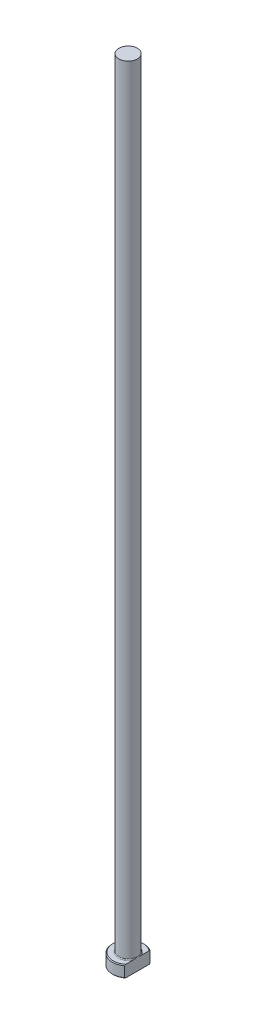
ISO-10303-21;
HEADER;
FILE_DESCRIPTION(('STEP AP214'),'2;1');
FILE_NAME('part.step','',(''),(''),'','','');
FILE_SCHEMA(('AUTOMOTIVE_DESIGN { 1 0 10303 214 1 1 1 1 }'));
ENDSEC;
DATA;
#1=APPLICATION_CONTEXT('core data for automotive mechanical design processes');
#2=APPLICATION_PROTOCOL_DEFINITION('international standard','automotive_design',2000,#1);
#3=PRODUCT_CONTEXT('',#1,'mechanical');
#4=PRODUCT('Part','Part','',(#3));
#5=PRODUCT_RELATED_PRODUCT_CATEGORY('part','',(#4));
#6=PRODUCT_DEFINITION_FORMATION('','',#4);
#7=PRODUCT_DEFINITION_CONTEXT('part definition',#1,'design');
#8=PRODUCT_DEFINITION('design','',#6,#7);
#9=PRODUCT_DEFINITION_SHAPE('','',#8);
#10=(LENGTH_UNIT() NAMED_UNIT(*) SI_UNIT(.MILLI.,.METRE.));
#11=(NAMED_UNIT(*) PLANE_ANGLE_UNIT() SI_UNIT($,.RADIAN.));
#12=(NAMED_UNIT(*) SI_UNIT($,.STERADIAN.) SOLID_ANGLE_UNIT());
#13=UNCERTAINTY_MEASURE_WITH_UNIT(LENGTH_MEASURE(1.E-05),#10,'distance_accuracy_value','');
#14=(GEOMETRIC_REPRESENTATION_CONTEXT(3) GLOBAL_UNCERTAINTY_ASSIGNED_CONTEXT((#13)) GLOBAL_UNIT_ASSIGNED_CONTEXT((#10,
#11,#12)) REPRESENTATION_CONTEXT('',''));
#15=CARTESIAN_POINT('',(0.,0.,0.));
#16=DIRECTION('',(0.,0.,1.));
#17=DIRECTION('',(1.,0.,0.));
#18=AXIS2_PLACEMENT_3D('',#15,#16,#17);
#19=CARTESIAN_POINT('',(0.,0.,0.));
#20=DIRECTION('',(0.,-1.,0.));
#21=DIRECTION('',(0.,0.,-1.));
#22=AXIS2_PLACEMENT_3D('',#19,#20,#21);
#23=PLANE('',#22);
#24=CARTESIAN_POINT('',(0.,0.,0.));
#25=DIRECTION('',(0.,-1.,0.));
#26=DIRECTION('',(0.,0.,-1.));
#27=AXIS2_PLACEMENT_3D('',#24,#25,#26);
#28=CIRCLE('',#27,3.79999999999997);
#29=CARTESIAN_POINT('',(2.34999999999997,0.,2.98621834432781));
#30=VERTEX_POINT('',#29);
#31=CARTESIAN_POINT('',(2.34999999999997,0.,-2.98621834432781));
#32=VERTEX_POINT('',#31);
#33=EDGE_CURVE('E98',#30,#32,#28,.T.);
#34=ORIENTED_EDGE('',*,*,#33,.T.);
#35=DIRECTION('',(0.,0.,1.));
#36=VECTOR('',#35,1.);
#37=CARTESIAN_POINT('',(2.34999999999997,0.,-3.23689666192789));
#38=LINE('',#37,#36);
#39=EDGE_CURVE('E83',#32,#30,#38,.T.);
#40=ORIENTED_EDGE('',*,*,#39,.T.);
#41=EDGE_LOOP('',(#34,#40));
#42=FACE_BOUND('',#41,.T.);
#43=ADVANCED_FACE('F32',(#42),#23,.T.);
#44=CARTESIAN_POINT('',(0.,259.958771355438,0.));
#45=DIRECTION('',(0.,1.,0.));
#46=DIRECTION('',(0.,0.,1.));
#47=AXIS2_PLACEMENT_3D('',#44,#45,#46);
#48=CYLINDRICAL_SURFACE('',#47,3.99999999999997);
#49=CARTESIAN_POINT('',(0.,2.80000000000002,0.));
#50=DIRECTION('',(0.,1.,0.));
#51=DIRECTION('',(0.,0.,1.));
#52=AXIS2_PLACEMENT_3D('',#49,#50,#51);
#53=CIRCLE('',#52,3.99999999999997);
#54=CARTESIAN_POINT('',(2.34999999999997,2.80000000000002,3.23689666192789));
#55=VERTEX_POINT('',#54);
#56=CARTESIAN_POINT('',(2.34999999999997,2.80000000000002,-3.23689666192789));
#57=VERTEX_POINT('',#56);
#58=EDGE_CURVE('E104',#55,#57,#53,.F.);
#59=ORIENTED_EDGE('',*,*,#58,.T.);
#60=DIRECTION('',(0.,-1.,0.));
#61=VECTOR('',#60,1.);
#62=CARTESIAN_POINT('',(2.34999999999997,200.,-3.23689666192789));
#63=LINE('',#62,#61);
#64=CARTESIAN_POINT('',(2.34999999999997,0.199999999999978,-3.23689666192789));
#65=VERTEX_POINT('',#64);
#66=EDGE_CURVE('E183',#57,#65,#63,.T.);
#67=ORIENTED_EDGE('',*,*,#66,.T.);
#68=CARTESIAN_POINT('',(0.,0.199999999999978,0.));
#69=DIRECTION('',(0.,-1.,0.));
#70=DIRECTION('',(0.,0.,-1.));
#71=AXIS2_PLACEMENT_3D('',#68,#69,#70);
#72=CIRCLE('',#71,3.99999999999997);
#73=CARTESIAN_POINT('',(2.34999999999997,0.199999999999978,3.23689666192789));
#74=VERTEX_POINT('',#73);
#75=EDGE_CURVE('E100',#65,#74,#72,.F.);
#76=ORIENTED_EDGE('',*,*,#75,.T.);
#77=DIRECTION('',(0.,-1.,0.));
#78=VECTOR('',#77,1.);
#79=CARTESIAN_POINT('',(2.34999999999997,200.,3.23689666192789));
#80=LINE('',#79,#78);
#81=EDGE_CURVE('E93',#55,#74,#80,.T.);
#82=ORIENTED_EDGE('',*,*,#81,.F.);
#83=EDGE_LOOP('',(#59,#67,#76,#82));
#84=FACE_BOUND('',#83,.T.);
#85=ADVANCED_FACE('F158',(#84),#48,.T.);
#86=CARTESIAN_POINT('',(-3.99999999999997,3.,0.));
#87=DIRECTION('',(0.,1.,0.));
#88=DIRECTION('',(0.,0.,1.));
#89=AXIS2_PLACEMENT_3D('',#86,#87,#88);
#90=PLANE('',#89);
#91=CARTESIAN_POINT('',(0.,3.,0.));
#92=DIRECTION('',(0.,1.,0.));
#93=DIRECTION('',(0.,0.,1.));
#94=AXIS2_PLACEMENT_3D('',#91,#92,#93);
#95=CIRCLE('',#94,3.80000000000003);
#96=CARTESIAN_POINT('',(2.34999999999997,3.,-2.98621834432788));
#97=VERTEX_POINT('',#96);
#98=CARTESIAN_POINT('',(2.34999999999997,3.,2.98621834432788));
#99=VERTEX_POINT('',#98);
#100=EDGE_CURVE('E178',#97,#99,#95,.T.);
#101=ORIENTED_EDGE('',*,*,#100,.T.);
#102=DIRECTION('',(0.,0.,-1.));
#103=VECTOR('',#102,1.);
#104=CARTESIAN_POINT('',(2.34999999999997,3.,0.));
#105=LINE('',#104,#103);
#106=CARTESIAN_POINT('',(2.34999999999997,2.99999999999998,0.989949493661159));
#107=VERTEX_POINT('',#106);
#108=EDGE_CURVE('E57',#99,#107,#105,.T.);
#109=ORIENTED_EDGE('',*,*,#108,.T.);
#110=CARTESIAN_POINT('',(0.,3.,0.));
#111=DIRECTION('',(0.,1.,0.));
#112=DIRECTION('',(0.,0.,1.));
#113=AXIS2_PLACEMENT_3D('',#110,#111,#112);
#114=CIRCLE('',#113,2.54999999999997);
#115=CARTESIAN_POINT('',(2.34999999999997,2.99999999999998,-0.98994949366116));
#116=VERTEX_POINT('',#115);
#117=EDGE_CURVE('E107',#107,#116,#114,.F.);
#118=ORIENTED_EDGE('',*,*,#117,.T.);
#119=EDGE_CURVE('E136',#116,#97,#105,.T.);
#120=ORIENTED_EDGE('',*,*,#119,.T.);
#121=EDGE_LOOP('',(#101,#109,#118,#120));
#122=FACE_BOUND('',#121,.T.);
#123=ADVANCED_FACE('F147',(#122),#90,.T.);
#124=CARTESIAN_POINT('',(0.,3.,0.));
#125=DIRECTION('',(0.,-1.,0.));
#126=DIRECTION('',(0.,0.,-1.));
#127=AXIS2_PLACEMENT_3D('',#124,#125,#126);
#128=CONICAL_SURFACE('',#127,3.80000000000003,0.785398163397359);
#129=ORIENTED_EDGE('',*,*,#58,.F.);
#130=CARTESIAN_POINT('',(2.34999999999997,-0.700856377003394,7.12322584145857));
#131=CARTESIAN_POINT('',(2.34999999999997,-0.58594192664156,7.00221702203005));
#132=CARTESIAN_POINT('',(2.34999999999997,-0.471176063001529,6.88106709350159));
#133=CARTESIAN_POINT('',(2.34999999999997,-0.241996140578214,6.63843358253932));
#134=CARTESIAN_POINT('',(2.34999999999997,-0.127582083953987,6.51694999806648));
#135=CARTESIAN_POINT('',(2.34999999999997,0.215169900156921,6.15179430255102));
#136=CARTESIAN_POINT('',(2.34999999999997,0.442895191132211,5.90754596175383));
#137=CARTESIAN_POINT('',(2.34999999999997,0.899497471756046,5.41318459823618));
#138=CARTESIAN_POINT('',(2.34999999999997,1.12833917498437,5.16303891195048));
#139=CARTESIAN_POINT('',(2.34999999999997,1.5824117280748,4.65967689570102));
#140=CARTESIAN_POINT('',(2.34999999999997,1.8076441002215,4.40646194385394));
#141=CARTESIAN_POINT('',(2.34999999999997,2.21600221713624,3.93721563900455));
#142=CARTESIAN_POINT('',(2.34999999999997,2.39996239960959,3.7219156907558));
#143=CARTESIAN_POINT('',(2.34999999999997,2.67143803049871,3.39502060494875));
#144=CARTESIAN_POINT('',(2.34999999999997,2.76124091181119,3.28532776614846));
#145=CARTESIAN_POINT('',(2.34999999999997,2.93886030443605,3.06434945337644));
#146=CARTESIAN_POINT('',(2.34999999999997,3.02667691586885,2.95306406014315));
#147=CARTESIAN_POINT('',(2.34999999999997,3.19949645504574,2.72877711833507));
#148=CARTESIAN_POINT('',(2.34999999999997,3.28450603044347,2.61578071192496));
#149=CARTESIAN_POINT('',(2.34999999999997,3.45108912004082,2.38722377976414));
#150=CARTESIAN_POINT('',(2.34999999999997,3.53266178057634,2.27166262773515));
#151=CARTESIAN_POINT('',(2.34999999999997,3.69088588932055,2.03753037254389));
#152=CARTESIAN_POINT('',(2.34999999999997,3.7675467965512,1.9189657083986));
#153=CARTESIAN_POINT('',(2.34999999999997,3.91413135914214,1.67777357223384));
#154=CARTESIAN_POINT('',(2.34999999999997,3.98405924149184,1.5551487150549));
#155=CARTESIAN_POINT('',(2.34999999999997,4.09761312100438,1.33668409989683));
#156=CARTESIAN_POINT('',(2.34999999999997,4.1434014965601,1.24197842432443));
#157=CARTESIAN_POINT('',(2.34999999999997,4.22781425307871,1.04934973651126));
#158=CARTESIAN_POINT('',(2.34999999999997,4.26643728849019,0.951426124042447));
#159=CARTESIAN_POINT('',(2.34999999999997,4.33394568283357,0.753323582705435));
#160=CARTESIAN_POINT('',(2.34999999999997,4.3629260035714,0.653177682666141));
#161=CARTESIAN_POINT('',(2.34999999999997,4.40928787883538,0.450234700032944));
#162=CARTESIAN_POINT('',(2.34999999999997,4.42667991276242,0.347440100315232));
#163=CARTESIAN_POINT('',(2.34999999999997,4.44509392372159,0.169206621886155));
#164=CARTESIAN_POINT('',(2.34999999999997,4.44931933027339,0.0940925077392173));
#165=CARTESIAN_POINT('',(2.34999999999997,4.45052785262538,-0.0561912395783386));
#166=CARTESIAN_POINT('',(2.34999999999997,4.4475119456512,-0.13136086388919));
#167=CARTESIAN_POINT('',(2.34999999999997,4.43440638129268,-0.281306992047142));
#168=CARTESIAN_POINT('',(2.34999999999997,4.42429455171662,-0.356081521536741));
#169=CARTESIAN_POINT('',(2.34999999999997,4.39757556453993,-0.504456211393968));
#170=CARTESIAN_POINT('',(2.34999999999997,4.38096681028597,-0.578056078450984));
#171=CARTESIAN_POINT('',(2.34999999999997,4.3332884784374,-0.756675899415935));
#172=CARTESIAN_POINT('',(2.34999999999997,4.29907594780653,-0.860854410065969));
#173=CARTESIAN_POINT('',(2.34999999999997,4.22140056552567,-1.06568624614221));
#174=CARTESIAN_POINT('',(2.34999999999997,4.17793098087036,-1.16633694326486));
#175=CARTESIAN_POINT('',(2.34999999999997,4.08383876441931,-1.36480952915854));
#176=CARTESIAN_POINT('',(2.34999999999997,4.03318169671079,-1.46261489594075));
#177=CARTESIAN_POINT('',(2.34999999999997,3.95330034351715,-1.60710986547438));
#178=CARTESIAN_POINT('',(2.34999999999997,3.92602819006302,-1.65489920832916));
#179=CARTESIAN_POINT('',(2.34999999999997,3.8703483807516,-1.74981001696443));
#180=CARTESIAN_POINT('',(2.34999999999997,3.84194077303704,-1.79693151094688));
#181=CARTESIAN_POINT('',(2.34999999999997,3.74736854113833,-1.95015020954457));
#182=CARTESIAN_POINT('',(2.34999999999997,3.67916021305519,-2.05498710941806));
#183=CARTESIAN_POINT('',(2.34999999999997,3.53901640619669,-2.26214963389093));
#184=CARTESIAN_POINT('',(2.34999999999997,3.46708001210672,-2.36447463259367));
#185=CARTESIAN_POINT('',(2.34999999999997,3.32034981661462,-2.56716934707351));
#186=CARTESIAN_POINT('',(2.34999999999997,3.24555383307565,-2.66753747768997));
#187=CARTESIAN_POINT('',(2.34999999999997,3.09379905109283,-2.8666288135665));
#188=CARTESIAN_POINT('',(2.34999999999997,3.0168401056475,-2.96535190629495));
#189=CARTESIAN_POINT('',(2.34999999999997,2.78304279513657,-3.26004190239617));
#190=CARTESIAN_POINT('',(2.34999999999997,2.62367547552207,-3.45399979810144));
#191=CARTESIAN_POINT('',(2.34999999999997,2.30072524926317,-3.83818937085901));
#192=CARTESIAN_POINT('',(2.34999999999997,2.13714428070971,-4.02842269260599));
#193=CARTESIAN_POINT('',(2.34999999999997,1.80677758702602,-4.40661405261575));
#194=CARTESIAN_POINT('',(2.34999999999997,1.6399871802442,-4.59456799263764));
#195=CARTESIAN_POINT('',(2.34999999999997,1.30429273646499,-4.96860985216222));
#196=CARTESIAN_POINT('',(2.34999999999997,1.13538847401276,-5.15469756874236));
#197=CARTESIAN_POINT('',(2.34999999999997,0.796258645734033,-5.52521155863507));
#198=CARTESIAN_POINT('',(2.34999999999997,0.626035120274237,-5.70963970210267));
#199=CARTESIAN_POINT('',(2.34999999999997,0.284419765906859,-6.07741061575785));
#200=CARTESIAN_POINT('',(2.34999999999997,0.113027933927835,-6.26075338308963));
#201=CARTESIAN_POINT('',(2.34999999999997,-0.112202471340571,-6.50049374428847));
#202=CARTESIAN_POINT('',(2.34999999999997,-0.165631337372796,-6.55727687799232));
#203=CARTESIAN_POINT('',(2.34999999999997,-0.272578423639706,-6.67077412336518));
#204=CARTESIAN_POINT('',(2.34999999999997,-0.326096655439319,-6.72748822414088));
#205=CARTESIAN_POINT('',(2.34999999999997,-0.433118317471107,-6.84074875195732));
#206=CARTESIAN_POINT('',(2.34999999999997,-0.486621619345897,-6.89729530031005));
#207=CARTESIAN_POINT('',(2.34999999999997,-0.593691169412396,-7.01031353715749));
#208=CARTESIAN_POINT('',(2.34999999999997,-0.647257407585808,-7.0667852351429));
#209=CARTESIAN_POINT('',(2.34999999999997,-0.700856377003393,-7.12322584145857));
#210=B_SPLINE_CURVE_WITH_KNOTS('',3,(#130,#131,#132,#133,#134,#135,#136,#137,#138,#139,#140,
#141,#142,#143,#144,#145,#146,#147,#148,#149,#150,#151,#152,#153,#154,#155,#156,#157,#158,#159,
#160,#161,#162,#163,#164,#165,#166,#167,#168,#169,#170,#171,#172,#173,#174,#175,#176,#177,#178,
#179,#180,#181,#182,#183,#184,#185,#186,#187,#188,#189,#190,#191,#192,#193,#194,#195,#196,#197,
#198,#199,#200,#201,#202,#203,#204,#205,#206,#207,#208,#209),.UNSPECIFIED.,.F.,.F.,(4,2,2,2,2,2,
2,2,2,2,2,2,2,2,2,2,2,2,2,2,2,2,2,2,2,2,2,2,2,2,2,2,2,2,2,2,2,2,2,4),(0.,0.500635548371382,
1.00127416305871,2.00308434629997,3.0201530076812,4.03678077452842,4.88626044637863,
5.31153593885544,5.73678994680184,6.16095168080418,6.58521815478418,7.00864136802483,
7.43179699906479,7.74715928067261,8.0625807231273,8.37479699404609,8.68673054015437,
8.91210094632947,9.13744094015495,9.36348819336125,9.58959103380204,9.91793468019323,
10.2465179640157,10.5767323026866,10.7417913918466,10.9068434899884,11.2819382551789,
11.6571255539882,12.032605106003,12.4081102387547,13.1610954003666,13.9137401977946,
14.6675815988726,15.4215040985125,16.174430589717,16.9273590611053,17.1612622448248,
17.3951984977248,17.6287386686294,17.8622456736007),.UNSPECIFIED.);
#211=EDGE_CURVE('E135',#55,#99,#210,.T.);
#212=ORIENTED_EDGE('',*,*,#211,.T.);
#213=ORIENTED_EDGE('',*,*,#100,.F.);
#214=EDGE_CURVE('E127',#97,#57,#210,.T.);
#215=ORIENTED_EDGE('',*,*,#214,.T.);
#216=EDGE_LOOP('',(#129,#212,#213,#215));
#217=FACE_BOUND('',#216,.T.);
#218=ADVANCED_FACE('F143',(#217),#128,.T.);
#219=CARTESIAN_POINT('',(0.,0.199999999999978,0.));
#220=DIRECTION('',(0.,1.,0.));
#221=DIRECTION('',(0.,0.,1.));
#222=AXIS2_PLACEMENT_3D('',#219,#220,#221);
#223=CONICAL_SURFACE('',#222,3.99999999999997,0.785398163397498);
#224=ORIENTED_EDGE('',*,*,#75,.F.);
#225=CARTESIAN_POINT('',(2.34999999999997,3.70085637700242,-7.12322584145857));
#226=CARTESIAN_POINT('',(2.34999999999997,3.58594192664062,-7.00221702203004));
#227=CARTESIAN_POINT('',(2.34999999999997,3.47117606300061,-6.88106709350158));
#228=CARTESIAN_POINT('',(2.34999999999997,3.24199614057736,-6.6384335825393));
#229=CARTESIAN_POINT('',(2.34999999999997,3.12758208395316,-6.51694999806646));
#230=CARTESIAN_POINT('',(2.34999999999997,2.78483009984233,-6.15179430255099));
#231=CARTESIAN_POINT('',(2.34999999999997,2.5571048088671,-5.90754596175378));
#232=CARTESIAN_POINT('',(2.34999999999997,2.10050252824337,-5.41318459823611));
#233=CARTESIAN_POINT('',(2.34999999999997,1.8716608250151,-5.1630389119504));
#234=CARTESIAN_POINT('',(2.34999999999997,1.41758827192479,-4.65967689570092));
#235=CARTESIAN_POINT('',(2.34999999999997,1.19235589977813,-4.40646194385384));
#236=CARTESIAN_POINT('',(2.34999999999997,0.783997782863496,-3.93721563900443));
#237=CARTESIAN_POINT('',(2.34999999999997,0.600037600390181,-3.72191569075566));
#238=CARTESIAN_POINT('',(2.34999999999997,0.328561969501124,-3.39502060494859));
#239=CARTESIAN_POINT('',(2.34999999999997,0.238759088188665,-3.28532776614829));
#240=CARTESIAN_POINT('',(2.34999999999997,0.0611396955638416,-3.06434945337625));
#241=CARTESIAN_POINT('',(2.34999999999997,-0.0266769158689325,-2.95306406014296));
#242=CARTESIAN_POINT('',(2.34999999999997,-0.199496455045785,-2.72877711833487));
#243=CARTESIAN_POINT('',(2.34999999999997,-0.284506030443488,-2.61578071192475));
#244=CARTESIAN_POINT('',(2.34999999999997,-0.4510891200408,-2.38722377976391));
#245=CARTESIAN_POINT('',(2.34999999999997,-0.532661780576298,-2.27166262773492));
#246=CARTESIAN_POINT('',(2.34999999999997,-0.690885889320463,-2.03753037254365));
#247=CARTESIAN_POINT('',(2.34999999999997,-0.767546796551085,-1.91896570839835));
#248=CARTESIAN_POINT('',(2.34999999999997,-0.914131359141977,-1.67777357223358));
#249=CARTESIAN_POINT('',(2.34999999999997,-0.984059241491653,-1.55514871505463));
#250=CARTESIAN_POINT('',(2.34999999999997,-1.09761312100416,-1.33668409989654));
#251=CARTESIAN_POINT('',(2.34999999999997,-1.14340149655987,-1.24197842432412));
#252=CARTESIAN_POINT('',(2.34999999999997,-1.22781425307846,-1.0493497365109));
#253=CARTESIAN_POINT('',(2.34999999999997,-1.26643728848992,-0.951426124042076));
#254=CARTESIAN_POINT('',(2.34999999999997,-1.33394568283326,-0.753323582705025));
#255=CARTESIAN_POINT('',(2.34999999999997,-1.36292600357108,-0.653177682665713));
#256=CARTESIAN_POINT('',(2.34999999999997,-1.40928787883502,-0.450234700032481));
#257=CARTESIAN_POINT('',(2.34999999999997,-1.42667991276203,-0.347440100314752));
#258=CARTESIAN_POINT('',(2.34999999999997,-1.44509392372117,-0.169206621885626));
#259=CARTESIAN_POINT('',(2.34999999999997,-1.44931933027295,-0.0940925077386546));
#260=CARTESIAN_POINT('',(2.34999999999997,-1.45052785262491,0.0561912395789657));
#261=CARTESIAN_POINT('',(2.34999999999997,-1.44751194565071,0.131360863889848));
#262=CARTESIAN_POINT('',(2.34999999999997,-1.43440638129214,0.281306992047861));
#263=CARTESIAN_POINT('',(2.34999999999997,-1.42429455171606,0.35608152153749));
#264=CARTESIAN_POINT('',(2.34999999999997,-1.39757556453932,0.504456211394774));
#265=CARTESIAN_POINT('',(2.34999999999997,-1.38096681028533,0.578056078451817));
#266=CARTESIAN_POINT('',(2.34999999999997,-1.33328847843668,0.756675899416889));
#267=CARTESIAN_POINT('',(2.34999999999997,-1.29907594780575,0.860854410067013));
#268=CARTESIAN_POINT('',(2.34999999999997,-1.22140056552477,1.06568624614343));
#269=CARTESIAN_POINT('',(2.34999999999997,-1.17793098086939,1.16633694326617));
#270=CARTESIAN_POINT('',(2.34999999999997,-1.08383876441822,1.36480952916));
#271=CARTESIAN_POINT('',(2.34999999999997,-1.03318169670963,1.4626148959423));
#272=CARTESIAN_POINT('',(2.34999999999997,-0.95330034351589,1.60710986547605));
#273=CARTESIAN_POINT('',(2.34999999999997,-0.92602819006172,1.65489920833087));
#274=CARTESIAN_POINT('',(2.34999999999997,-0.870348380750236,1.74981001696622));
#275=CARTESIAN_POINT('',(2.34999999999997,-0.841940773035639,1.7969315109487));
#276=CARTESIAN_POINT('',(2.34999999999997,-0.747368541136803,1.95015020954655));
#277=CARTESIAN_POINT('',(2.34999999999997,-0.679160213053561,2.05498710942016));
#278=CARTESIAN_POINT('',(2.34999999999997,-0.539016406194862,2.26214963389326));
#279=CARTESIAN_POINT('',(2.34999999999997,-0.4670800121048,2.36447463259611));
#280=CARTESIAN_POINT('',(2.34999999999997,-0.320349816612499,2.56716934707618));
#281=CARTESIAN_POINT('',(2.34999999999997,-0.245553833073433,2.66753747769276));
#282=CARTESIAN_POINT('',(2.34999999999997,-0.0937990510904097,2.86662881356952));
#283=CARTESIAN_POINT('',(2.34999999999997,-0.0168401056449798,2.96535190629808));
#284=CARTESIAN_POINT('',(2.34999999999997,0.216957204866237,3.26004190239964));
#285=CARTESIAN_POINT('',(2.34999999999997,0.376324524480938,3.45399979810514));
#286=CARTESIAN_POINT('',(2.34999999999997,0.699274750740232,3.83818937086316));
#287=CARTESIAN_POINT('',(2.34999999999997,0.86285571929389,4.02842269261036));
#288=CARTESIAN_POINT('',(2.34999999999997,1.19322241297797,4.40661405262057));
#289=CARTESIAN_POINT('',(2.34999999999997,1.36001281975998,4.5945679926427));
#290=CARTESIAN_POINT('',(2.34999999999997,1.69570726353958,4.96860985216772));
#291=CARTESIAN_POINT('',(2.34999999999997,1.86461152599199,5.15469756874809));
#292=CARTESIAN_POINT('',(2.34999999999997,2.2037413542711,5.52521155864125));
#293=CARTESIAN_POINT('',(2.34999999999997,2.37396487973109,5.70963970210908));
#294=CARTESIAN_POINT('',(2.34999999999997,2.71558023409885,6.07741061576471));
#295=CARTESIAN_POINT('',(2.34999999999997,2.88697206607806,6.26075338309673));
#296=CARTESIAN_POINT('',(2.34999999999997,3.11220247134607,6.50049374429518));
#297=CARTESIAN_POINT('',(2.34999999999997,3.16563133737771,6.55727687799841));
#298=CARTESIAN_POINT('',(2.34999999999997,3.27257842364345,6.67077412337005));
#299=CARTESIAN_POINT('',(2.34999999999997,3.32609665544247,6.72748822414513));
#300=CARTESIAN_POINT('',(2.34999999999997,3.43311831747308,6.84074875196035));
#301=CARTESIAN_POINT('',(2.34999999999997,3.48662161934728,6.89729530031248));
#302=CARTESIAN_POINT('',(2.34999999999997,3.59369116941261,7.0103135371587));
#303=CARTESIAN_POINT('',(2.34999999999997,3.64725740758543,7.0667852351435));
#304=CARTESIAN_POINT('',(2.34999999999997,3.70085637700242,7.12322584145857));
#305=B_SPLINE_CURVE_WITH_KNOTS('',3,(#225,#226,#227,#228,#229,#230,#231,#232,#233,#234,#235,
#236,#237,#238,#239,#240,#241,#242,#243,#244,#245,#246,#247,#248,#249,#250,#251,#252,#253,#254,
#255,#256,#257,#258,#259,#260,#261,#262,#263,#264,#265,#266,#267,#268,#269,#270,#271,#272,#273,
#274,#275,#276,#277,#278,#279,#280,#281,#282,#283,#284,#285,#286,#287,#288,#289,#290,#291,#292,
#293,#294,#295,#296,#297,#298,#299,#300,#301,#302,#303,#304),.UNSPECIFIED.,.F.,.F.,(4,2,2,2,2,2,
2,2,2,2,2,2,2,2,2,2,2,2,2,2,2,2,2,2,2,2,2,2,2,2,2,2,2,2,2,2,2,2,2,4),(0.,0.500635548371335,
1.00127416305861,2.00308434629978,3.02015300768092,4.03678077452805,4.88626044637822,
5.311535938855,5.73678994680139,6.1609516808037,6.58521815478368,7.00864136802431,
7.43179699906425,7.7471592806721,8.06258072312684,8.37479699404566,8.68673054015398,
8.91210094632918,9.13744094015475,9.36348819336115,9.58959103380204,9.91793468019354,
10.2465179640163,10.5767323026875,10.7417913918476,10.9068434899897,11.2819382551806,
11.6571255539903,12.0326051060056,12.4081102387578,13.1610954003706,13.9137401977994,
14.6675815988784,15.4215040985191,16.1744305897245,16.9273590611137,17.1612622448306,
17.3951984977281,17.6287386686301,17.862245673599),.UNSPECIFIED.);
#306=EDGE_CURVE('E86',#65,#32,#305,.T.);
#307=ORIENTED_EDGE('',*,*,#306,.T.);
#308=ORIENTED_EDGE('',*,*,#33,.F.);
#309=EDGE_CURVE('E89',#30,#74,#305,.T.);
#310=ORIENTED_EDGE('',*,*,#309,.T.);
#311=EDGE_LOOP('',(#224,#307,#308,#310));
#312=FACE_BOUND('',#311,.T.);
#313=ADVANCED_FACE('F97',(#312),#223,.T.);
#314=CARTESIAN_POINT('',(0.,3.19999999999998,0.));
#315=DIRECTION('',(0.,1.,0.));
#316=DIRECTION('',(0.,0.,1.));
#317=AXIS2_PLACEMENT_3D('',#314,#315,#316);
#318=TOROIDAL_SURFACE('',#317,2.54999999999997,0.2);
#319=CARTESIAN_POINT('',(2.34999999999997,3.19999999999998,0.));
#320=CARTESIAN_POINT('',(2.34999999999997,3.20000050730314,3.97301915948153E-11));
#321=CARTESIAN_POINT('',(2.34999999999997,3.20000101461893,-1.63653131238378E-07));
#322=CARTESIAN_POINT('',(2.34999999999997,3.20000197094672,-6.37225615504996E-07));
#323=CARTESIAN_POINT('',(2.34999999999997,3.20000241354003,-9.56393877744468E-07));
#324=CARTESIAN_POINT('',(2.34999999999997,3.20000331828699,-1.71856519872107E-06));
#325=CARTESIAN_POINT('',(2.34999999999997,3.20000377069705,-2.17342707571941E-06));
#326=CARTESIAN_POINT('',(2.34999999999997,3.20000459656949,-3.12835726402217E-06));
#327=CARTESIAN_POINT('',(2.34999999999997,3.20000497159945,-3.62715530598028E-06));
#328=CARTESIAN_POINT('',(2.34999999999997,3.20000632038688,-5.51226928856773E-06));
#329=CARTESIAN_POINT('',(2.34999999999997,3.20000721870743,-6.95455039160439E-06));
#330=CARTESIAN_POINT('',(2.34999999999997,3.20000873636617,-9.84867466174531E-06));
#331=CARTESIAN_POINT('',(2.34999999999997,3.20000937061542,-1.12930741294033E-05));
#332=CARTESIAN_POINT('',(2.34999999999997,3.20001195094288,-1.72675053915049E-05));
#333=CARTESIAN_POINT('',(2.34999999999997,3.20001382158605,-2.18342580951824E-05));
#334=CARTESIAN_POINT('',(2.34999999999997,3.20001665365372,-3.0562235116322E-05));
#335=CARTESIAN_POINT('',(2.34999999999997,3.20001770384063,-3.46947501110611E-05));
#336=CARTESIAN_POINT('',(2.34999999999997,3.20002522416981,-6.49852707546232E-05));
#337=CARTESIAN_POINT('',(2.34999999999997,3.20003079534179,-9.1319424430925E-05));
#338=CARTESIAN_POINT('',(2.34999999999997,3.20005517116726,-0.000194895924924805));
#339=CARTESIAN_POINT('',(2.34999999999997,3.20007855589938,-0.000271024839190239));
#340=CARTESIAN_POINT('',(2.34999999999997,3.20016914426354,-0.000571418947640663));
#341=CARTESIAN_POINT('',(2.34999999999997,3.20023327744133,-0.000796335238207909));
#342=CARTESIAN_POINT('',(2.34999999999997,3.20048915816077,-0.00168650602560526));
#343=CARTESIAN_POINT('',(2.34999999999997,3.20068469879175,-0.00235093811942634));
#344=CARTESIAN_POINT('',(2.34999999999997,3.2014949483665,-0.00511204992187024));
#345=CARTESIAN_POINT('',(2.34999999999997,3.20210492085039,-0.00720975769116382));
#346=CARTESIAN_POINT('',(2.34999999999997,3.20787958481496,-0.0270590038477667));
#347=CARTESIAN_POINT('',(2.34999999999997,3.21306460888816,-0.0448062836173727));
#348=CARTESIAN_POINT('',(2.34999999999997,3.22319239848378,-0.0796159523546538));
#349=CARTESIAN_POINT('',(2.34999999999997,3.22813669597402,-0.0966779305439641));
#350=CARTESIAN_POINT('',(2.34999999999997,3.23859474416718,-0.132940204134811));
#351=CARTESIAN_POINT('',(2.34999999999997,3.24410273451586,-0.152142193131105));
#352=CARTESIAN_POINT('',(2.34999999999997,3.25508732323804,-0.190778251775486));
#353=CARTESIAN_POINT('',(2.34999999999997,3.260562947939,-0.210212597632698));
#354=CARTESIAN_POINT('',(2.34999999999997,3.27370944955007,-0.257444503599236));
#355=CARTESIAN_POINT('',(2.34999999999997,3.28131640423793,-0.285259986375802));
#356=CARTESIAN_POINT('',(2.34999999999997,3.29598901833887,-0.340268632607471));
#357=CARTESIAN_POINT('',(2.34999999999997,3.30306356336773,-0.367459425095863));
#358=CARTESIAN_POINT('',(2.34999999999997,3.32130563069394,-0.439911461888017));
#359=CARTESIAN_POINT('',(2.34999999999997,3.33209700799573,-0.485269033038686));
#360=CARTESIAN_POINT('',(2.34999999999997,3.35207859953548,-0.576761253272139));
#361=CARTESIAN_POINT('',(2.34999999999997,3.36125388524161,-0.622899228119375));
#362=CARTESIAN_POINT('',(2.34999999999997,3.37792670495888,-0.719572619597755));
#363=CARTESIAN_POINT('',(2.34999999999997,3.3852125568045,-0.770145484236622));
#364=CARTESIAN_POINT('',(2.34999999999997,3.39588167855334,-0.87157933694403));
#365=CARTESIAN_POINT('',(2.34999999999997,3.39927813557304,-0.92243876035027));
#366=CARTESIAN_POINT('',(2.34999999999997,3.4002008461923,-0.998268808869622));
#367=CARTESIAN_POINT('',(2.34999999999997,3.39983763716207,-1.02321254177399));
#368=CARTESIAN_POINT('',(2.34999999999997,3.39747624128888,-1.07301750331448));
#369=CARTESIAN_POINT('',(2.34999999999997,3.3954790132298,-1.09787877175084));
#370=CARTESIAN_POINT('',(2.34999999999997,3.38951136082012,-1.14688451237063));
#371=CARTESIAN_POINT('',(2.34999999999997,3.38557982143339,-1.17103355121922));
#372=CARTESIAN_POINT('',(2.34999999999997,3.37522613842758,-1.21877292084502));
#373=CARTESIAN_POINT('',(2.34999999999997,3.36880975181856,-1.24236441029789));
#374=CARTESIAN_POINT('',(2.34999999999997,3.3551050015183,-1.28139211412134));
#375=CARTESIAN_POINT('',(2.34999999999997,3.34867539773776,-1.29712639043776));
#376=CARTESIAN_POINT('',(2.34999999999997,3.33376103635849,-1.32763329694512));
#377=CARTESIAN_POINT('',(2.34999999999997,3.32527759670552,-1.34240653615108));
#378=CARTESIAN_POINT('',(2.34999999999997,3.30996401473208,-1.36406737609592));
#379=CARTESIAN_POINT('',(2.34999999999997,3.30402750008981,-1.37158321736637));
#380=CARTESIAN_POINT('',(2.34999999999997,3.29119867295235,-1.38575961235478));
#381=CARTESIAN_POINT('',(2.34999999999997,3.28430748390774,-1.39242115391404));
#382=CARTESIAN_POINT('',(2.34999999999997,3.27111764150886,-1.40316348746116));
#383=CARTESIAN_POINT('',(2.34999999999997,3.26502095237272,-1.40748979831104));
#384=CARTESIAN_POINT('',(2.34999999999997,3.25221216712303,-1.41511389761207));
#385=CARTESIAN_POINT('',(2.34999999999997,3.24550106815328,-1.41841331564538));
#386=CARTESIAN_POINT('',(2.34999999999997,3.23285600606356,-1.42321218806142));
#387=CARTESIAN_POINT('',(2.34999999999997,3.22700595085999,-1.42493102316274));
#388=CARTESIAN_POINT('',(2.34999999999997,3.21509932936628,-1.42735933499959));
#389=CARTESIAN_POINT('',(2.34999999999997,3.20904291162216,-1.42806952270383));
#390=CARTESIAN_POINT('',(2.34999999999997,3.19688696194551,-1.42841721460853));
#391=CARTESIAN_POINT('',(2.34999999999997,3.19078736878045,-1.42805261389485));
#392=CARTESIAN_POINT('',(2.34999999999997,3.17874187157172,-1.42628029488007));
#393=CARTESIAN_POINT('',(2.34999999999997,3.17279604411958,-1.42487206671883));
#394=CARTESIAN_POINT('',(2.34999999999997,3.16130302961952,-1.42116093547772));
#395=CARTESIAN_POINT('',(2.34999999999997,3.15575093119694,-1.41887295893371));
#396=CARTESIAN_POINT('',(2.34999999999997,3.1450217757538,-1.41355066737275));
#397=CARTESIAN_POINT('',(2.34999999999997,3.13984483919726,-1.41051611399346));
#398=CARTESIAN_POINT('',(2.34999999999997,3.12662898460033,-1.40165617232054));
#399=CARTESIAN_POINT('',(2.34999999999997,3.11894184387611,-1.39530630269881));
#400=CARTESIAN_POINT('',(2.34999999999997,3.10463862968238,-1.38149172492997));
#401=CARTESIAN_POINT('',(2.34999999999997,3.098026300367,-1.3740232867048));
#402=CARTESIAN_POINT('',(2.34999999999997,3.08144643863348,-1.35283380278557));
#403=CARTESIAN_POINT('',(2.34999999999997,3.07238753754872,-1.33840776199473));
#404=CARTESIAN_POINT('',(2.34999999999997,3.05644883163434,-1.30845169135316));
#405=CARTESIAN_POINT('',(2.34999999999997,3.04957029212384,-1.29292102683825));
#406=CARTESIAN_POINT('',(2.34999999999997,3.03757508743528,-1.26136930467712));
#407=CARTESIAN_POINT('',(2.34999999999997,3.03244275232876,-1.24535409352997));
#408=CARTESIAN_POINT('',(2.34999999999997,3.02353297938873,-1.21294404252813));
#409=CARTESIAN_POINT('',(2.34999999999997,3.01975697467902,-1.19654882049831));
#410=CARTESIAN_POINT('',(2.34999999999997,3.01003121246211,-1.14664956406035));
#411=CARTESIAN_POINT('',(2.34999999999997,3.00581272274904,-1.11281111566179));
#412=CARTESIAN_POINT('',(2.34999999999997,2.9993669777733,-1.02798337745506));
#413=CARTESIAN_POINT('',(2.34999999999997,2.99918477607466,-0.976864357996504));
#414=CARTESIAN_POINT('',(2.34999999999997,3.00375848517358,-0.874705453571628));
#415=CARTESIAN_POINT('',(2.34999999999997,3.00853512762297,-0.823666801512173));
#416=CARTESIAN_POINT('',(2.34999999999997,3.02118536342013,-0.725382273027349));
#417=CARTESIAN_POINT('',(2.34999999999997,3.02883644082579,-0.678106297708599));
#418=CARTESIAN_POINT('',(2.34999999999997,3.04631118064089,-0.584387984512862));
#419=CARTESIAN_POINT('',(2.34999999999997,3.05611566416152,-0.537941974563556));
#420=CARTESIAN_POINT('',(2.34999999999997,3.07458329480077,-0.457342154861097));
#421=CARTESIAN_POINT('',(2.34999999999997,3.08288953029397,-0.423104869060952));
#422=CARTESIAN_POINT('',(2.34999999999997,3.100392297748,-0.353909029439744));
#423=CARTESIAN_POINT('',(2.34999999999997,3.10960639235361,-0.318954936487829));
#424=CARTESIAN_POINT('',(2.34999999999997,3.12565453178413,-0.259778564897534));
#425=CARTESIAN_POINT('',(2.34999999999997,3.13236140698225,-0.235521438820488));
#426=CARTESIAN_POINT('',(2.34999999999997,3.14587896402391,-0.187317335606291));
#427=CARTESIAN_POINT('',(2.34999999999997,3.15268775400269,-0.163369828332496));
#428=CARTESIAN_POINT('',(2.34999999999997,3.1656491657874,-0.118168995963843));
#429=CARTESIAN_POINT('',(2.34999999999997,3.17179049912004,-0.0969123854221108));
#430=CARTESIAN_POINT('',(2.34999999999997,3.18438963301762,-0.0535409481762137));
#431=CARTESIAN_POINT('',(2.34999999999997,3.19085004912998,-0.0314268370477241));
#432=CARTESIAN_POINT('',(2.34999999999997,3.19789544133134,-0.00720839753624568));
#433=CARTESIAN_POINT('',(2.34999999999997,3.19850583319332,-0.00510934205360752));
#434=CARTESIAN_POINT('',(2.34999999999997,3.19931618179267,-0.00234791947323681));
#435=CARTESIAN_POINT('',(2.34999999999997,3.19951141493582,-0.00168452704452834));
#436=CARTESIAN_POINT('',(2.34999999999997,3.19976692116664,-0.000795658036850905));
#437=CARTESIAN_POINT('',(2.34999999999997,3.19983097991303,-0.000571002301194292));
#438=CARTESIAN_POINT('',(2.34999999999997,3.19992147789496,-0.000270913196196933));
#439=CARTESIAN_POINT('',(2.34999999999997,3.19994484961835,-0.000194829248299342));
#440=CARTESIAN_POINT('',(2.34999999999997,3.19996921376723,-9.13049088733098E-05));
#441=CARTESIAN_POINT('',(2.34999999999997,3.19997478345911,-6.49772799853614E-05));
#442=CARTESIAN_POINT('',(2.34999999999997,3.19998230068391,-3.46933684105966E-05));
#443=CARTESIAN_POINT('',(2.34999999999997,3.19998335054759,-3.0561236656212E-05));
#444=CARTESIAN_POINT('',(2.34999999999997,3.19998618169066,-2.18340265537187E-05));
#445=CARTESIAN_POINT('',(2.34999999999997,3.19998805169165,-1.72676374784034E-05));
#446=CARTESIAN_POINT('',(2.34999999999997,3.19999063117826,-1.1293576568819E-05));
#447=CARTESIAN_POINT('',(2.34999999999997,3.19999126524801,-9.84920577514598E-06));
#448=CARTESIAN_POINT('',(2.34999999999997,3.19999278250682,-6.95510752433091E-06));
#449=CARTESIAN_POINT('',(2.34999999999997,3.19999368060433,-5.51282056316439E-06));
#450=CARTESIAN_POINT('',(2.34999999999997,3.1999950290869,-3.62766169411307E-06));
#451=CARTESIAN_POINT('',(2.34999999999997,3.19999540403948,-3.12884229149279E-06));
#452=CARTESIAN_POINT('',(2.34999999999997,3.19999622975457,-2.1738554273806E-06));
#453=CARTESIAN_POINT('',(2.34999999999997,3.19999668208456,-1.71895785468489E-06));
#454=CARTESIAN_POINT('',(2.34999999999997,3.19999758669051,-9.56701781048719E-07));
#455=CARTESIAN_POINT('',(2.34999999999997,3.19999802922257,-6.37487274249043E-07));
#456=CARTESIAN_POINT('',(2.34999999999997,3.19999898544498,-1.63799559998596E-07));
#457=CARTESIAN_POINT('',(2.34999999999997,3.19999949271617,-3.97286763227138E-11));
#458=CARTESIAN_POINT('',(2.34999999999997,3.19999999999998,0.));
#459=B_SPLINE_CURVE_WITH_KNOTS('',3,(#319,#320,#321,#322,#323,#324,#325,#326,#327,#328,#329,
#330,#331,#332,#333,#334,#335,#336,#337,#338,#339,#340,#341,#342,#343,#344,#345,#346,#347,#348,
#349,#350,#351,#352,#353,#354,#355,#356,#357,#358,#359,#360,#361,#362,#363,#364,#365,#366,#367,
#368,#369,#370,#371,#372,#373,#374,#375,#376,#377,#378,#379,#380,#381,#382,#383,#384,#385,#386,
#387,#388,#389,#390,#391,#392,#393,#394,#395,#396,#397,#398,#399,#400,#401,#402,#403,#404,#405,
#406,#407,#408,#409,#410,#411,#412,#413,#414,#415,#416,#417,#418,#419,#420,#421,#422,#423,#424,
#425,#426,#427,#428,#429,#430,#431,#432,#433,#434,#435,#436,#437,#438,#439,#440,#441,#442,#443,
#444,#445,#446,#447,#448,#449,#450,#451,#452,#453,#454,#455,#456,#457,#458),.UNSPECIFIED.,.T.,
.F.,(4,2,2,2,2,2,2,2,2,2,2,2,2,2,2,2,2,2,2,2,2,2,2,2,2,2,2,2,2,2,2,2,2,2,2,2,2,2,2,2,2,2,2,2,2,
2,2,2,2,2,2,2,2,2,2,2,2,2,2,2,2,2,2,2,2,2,2,2,2,4),(0.,1.52815233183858E-06,
3.16151347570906E-06,5.07598848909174E-06,6.94672329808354E-06,1.20236100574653E-05,
1.67522119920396E-05,3.15258107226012E-05,4.43009343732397E-05,0.000125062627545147,
0.000363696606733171,0.00106562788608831,0.00314310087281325,0.00969727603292,
0.0651627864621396,0.118455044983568,0.178383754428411,0.23895657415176,0.325465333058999,
0.409751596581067,0.549599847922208,0.690678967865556,0.843870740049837,0.996541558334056,
1.07134060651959,1.14609579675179,1.21940608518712,1.29254753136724,1.34344322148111,
1.3943063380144,1.42297722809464,1.45161466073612,1.47396609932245,1.49628188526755,
1.51449565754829,1.5326965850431,1.55093318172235,1.56917869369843,1.5871274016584,
1.60508184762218,1.63482087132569,1.66466136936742,1.71547705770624,1.76632218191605,
1.81669819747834,1.86712728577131,1.96917546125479,2.12216244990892,2.27579162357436,
2.41939223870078,2.56176232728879,2.667446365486,2.77588510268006,2.85138624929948,
2.92607549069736,2.99245400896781,3.06156674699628,3.06812515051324,3.0701993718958,
3.07090048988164,3.07113898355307,3.07121972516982,3.07123249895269,3.07124727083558,
3.07125199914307,3.07125707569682,3.07125894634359,3.07126086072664,3.07126249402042,
3.07126402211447),.UNSPECIFIED.);
#460=CARTESIAN_POINT('',(2.34999999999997,3.19999999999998,0.));
#461=VERTEX_POINT('',#460);
#462=EDGE_CURVE('E11',#116,#461,#459,.T.);
#463=ORIENTED_EDGE('',*,*,#462,.F.);
#464=ORIENTED_EDGE('',*,*,#117,.F.);
#465=CARTESIAN_POINT('',(2.34999999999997,3.19999999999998,0.));
#466=CARTESIAN_POINT('',(2.34999999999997,3.19999949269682,-3.97301768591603E-11));
#467=CARTESIAN_POINT('',(2.34999999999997,3.19999898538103,1.63653131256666E-07));
#468=CARTESIAN_POINT('',(2.34999999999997,3.19999802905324,6.37225615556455E-07));
#469=CARTESIAN_POINT('',(2.34999999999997,3.19999758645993,9.56393877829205E-07));
#470=CARTESIAN_POINT('',(2.34999999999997,3.19999668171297,1.71856519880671E-06));
#471=CARTESIAN_POINT('',(2.34999999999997,3.19999622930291,2.17342707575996E-06));
#472=CARTESIAN_POINT('',(2.34999999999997,3.19999540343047,3.12835726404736E-06));
#473=CARTESIAN_POINT('',(2.34999999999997,3.19999502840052,3.62715530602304E-06));
#474=CARTESIAN_POINT('',(2.34999999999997,3.19999367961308,5.51226928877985E-06));
#475=CARTESIAN_POINT('',(2.34999999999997,3.19999278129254,6.95455039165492E-06));
#476=CARTESIAN_POINT('',(2.34999999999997,3.19999126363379,9.84867466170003E-06));
#477=CARTESIAN_POINT('',(2.34999999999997,3.19999062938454,1.12930741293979E-05));
#478=CARTESIAN_POINT('',(2.34999999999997,3.19998804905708,1.72675053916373E-05));
#479=CARTESIAN_POINT('',(2.34999999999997,3.19998617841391,2.18342580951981E-05));
#480=CARTESIAN_POINT('',(2.34999999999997,3.19998334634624,3.05622351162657E-05));
#481=CARTESIAN_POINT('',(2.34999999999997,3.19998229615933,3.46947501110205E-05));
#482=CARTESIAN_POINT('',(2.34999999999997,3.19997477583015,6.49852707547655E-05));
#483=CARTESIAN_POINT('',(2.34999999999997,3.19996920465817,9.1319424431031E-05));
#484=CARTESIAN_POINT('',(2.34999999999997,3.1999448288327,0.000194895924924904));
#485=CARTESIAN_POINT('',(2.34999999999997,3.19992144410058,0.000271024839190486));
#486=CARTESIAN_POINT('',(2.34999999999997,3.19983085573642,0.000571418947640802));
#487=CARTESIAN_POINT('',(2.34999999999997,3.19976672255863,0.000796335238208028));
#488=CARTESIAN_POINT('',(2.34999999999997,3.19951084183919,0.0016865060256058));
#489=CARTESIAN_POINT('',(2.34999999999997,3.19931530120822,0.00235093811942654));
#490=CARTESIAN_POINT('',(2.34999999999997,3.19850505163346,0.00511204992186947));
#491=CARTESIAN_POINT('',(2.34999999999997,3.19789507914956,0.00720975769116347));
#492=CARTESIAN_POINT('',(2.34999999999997,3.19212041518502,0.0270590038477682));
#493=CARTESIAN_POINT('',(2.34999999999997,3.1869353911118,0.0448062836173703));
#494=CARTESIAN_POINT('',(2.34999999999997,3.17680760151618,0.0796159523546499));
#495=CARTESIAN_POINT('',(2.34999999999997,3.17186330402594,0.0966779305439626));
#496=CARTESIAN_POINT('',(2.34999999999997,3.16140525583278,0.132940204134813));
#497=CARTESIAN_POINT('',(2.34999999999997,3.1558972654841,0.152142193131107));
#498=CARTESIAN_POINT('',(2.34999999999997,3.14491267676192,0.190778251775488));
#499=CARTESIAN_POINT('',(2.34999999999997,3.13943705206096,0.210212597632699));
#500=CARTESIAN_POINT('',(2.34999999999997,3.12629055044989,0.257444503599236));
#501=CARTESIAN_POINT('',(2.34999999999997,3.11868359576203,0.285259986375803));
#502=CARTESIAN_POINT('',(2.34999999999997,3.10401098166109,0.340268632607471));
#503=CARTESIAN_POINT('',(2.34999999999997,3.09693643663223,0.367459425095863));
#504=CARTESIAN_POINT('',(2.34999999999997,3.07869436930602,0.439911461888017));
#505=CARTESIAN_POINT('',(2.34999999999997,3.06790299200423,0.485269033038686));
#506=CARTESIAN_POINT('',(2.34999999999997,3.04792140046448,0.576761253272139));
#507=CARTESIAN_POINT('',(2.34999999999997,3.03874611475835,0.622899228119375));
#508=CARTESIAN_POINT('',(2.34999999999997,3.02207329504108,0.719572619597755));
#509=CARTESIAN_POINT('',(2.34999999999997,3.01478744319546,0.770145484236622));
#510=CARTESIAN_POINT('',(2.34999999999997,3.00411832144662,0.87157933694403));
#511=CARTESIAN_POINT('',(2.34999999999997,3.00072186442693,0.92243876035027));
#512=CARTESIAN_POINT('',(2.34999999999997,2.99979915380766,0.998268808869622));
#513=CARTESIAN_POINT('',(2.34999999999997,3.00016236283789,1.02321254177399));
#514=CARTESIAN_POINT('',(2.34999999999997,3.00252375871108,1.07301750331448));
#515=CARTESIAN_POINT('',(2.34999999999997,3.00452098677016,1.09787877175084));
#516=CARTESIAN_POINT('',(2.34999999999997,3.01048863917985,1.14688451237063));
#517=CARTESIAN_POINT('',(2.34999999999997,3.01442017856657,1.17103355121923));
#518=CARTESIAN_POINT('',(2.34999999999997,3.02477386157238,1.21877292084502));
#519=CARTESIAN_POINT('',(2.34999999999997,3.0311902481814,1.24236441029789));
#520=CARTESIAN_POINT('',(2.34999999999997,3.04489499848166,1.28139211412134));
#521=CARTESIAN_POINT('',(2.34999999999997,3.0513246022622,1.29712639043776));
#522=CARTESIAN_POINT('',(2.34999999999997,3.06623896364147,1.32763329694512));
#523=CARTESIAN_POINT('',(2.34999999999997,3.07472240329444,1.34240653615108));
#524=CARTESIAN_POINT('',(2.34999999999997,3.09003598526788,1.36406737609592));
#525=CARTESIAN_POINT('',(2.34999999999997,3.09597249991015,1.37158321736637));
#526=CARTESIAN_POINT('',(2.34999999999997,3.10880132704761,1.38575961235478));
#527=CARTESIAN_POINT('',(2.34999999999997,3.11569251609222,1.39242115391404));
#528=CARTESIAN_POINT('',(2.34999999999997,3.1288823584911,1.40316348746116));
#529=CARTESIAN_POINT('',(2.34999999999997,3.13497904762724,1.40748979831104));
#530=CARTESIAN_POINT('',(2.34999999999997,3.14778783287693,1.41511389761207));
#531=CARTESIAN_POINT('',(2.34999999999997,3.15449893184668,1.41841331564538));
#532=CARTESIAN_POINT('',(2.34999999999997,3.1671439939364,1.42321218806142));
#533=CARTESIAN_POINT('',(2.34999999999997,3.17299404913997,1.42493102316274));
#534=CARTESIAN_POINT('',(2.34999999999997,3.18490067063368,1.42735933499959));
#535=CARTESIAN_POINT('',(2.34999999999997,3.19095708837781,1.42806952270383));
#536=CARTESIAN_POINT('',(2.34999999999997,3.20311303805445,1.42841721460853));
#537=CARTESIAN_POINT('',(2.34999999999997,3.20921263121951,1.42805261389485));
#538=CARTESIAN_POINT('',(2.34999999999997,3.22125812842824,1.42628029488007));
#539=CARTESIAN_POINT('',(2.34999999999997,3.22720395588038,1.42487206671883));
#540=CARTESIAN_POINT('',(2.34999999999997,3.23869697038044,1.42116093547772));
#541=CARTESIAN_POINT('',(2.34999999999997,3.24424906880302,1.41887295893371));
#542=CARTESIAN_POINT('',(2.34999999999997,3.25497822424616,1.41355066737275));
#543=CARTESIAN_POINT('',(2.34999999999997,3.26015516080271,1.41051611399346));
#544=CARTESIAN_POINT('',(2.34999999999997,3.27337101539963,1.40165617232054));
#545=CARTESIAN_POINT('',(2.34999999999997,3.28105815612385,1.39530630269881));
#546=CARTESIAN_POINT('',(2.34999999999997,3.29536137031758,1.38149172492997));
#547=CARTESIAN_POINT('',(2.34999999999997,3.30197369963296,1.3740232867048));
#548=CARTESIAN_POINT('',(2.34999999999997,3.31855356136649,1.35283380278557));
#549=CARTESIAN_POINT('',(2.34999999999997,3.32761246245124,1.33840776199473));
#550=CARTESIAN_POINT('',(2.34999999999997,3.34355116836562,1.30845169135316));
#551=CARTESIAN_POINT('',(2.34999999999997,3.35042970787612,1.29292102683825));
#552=CARTESIAN_POINT('',(2.34999999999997,3.36242491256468,1.26136930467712));
#553=CARTESIAN_POINT('',(2.34999999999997,3.36755724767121,1.24535409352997));
#554=CARTESIAN_POINT('',(2.34999999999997,3.37646702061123,1.21294404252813));
#555=CARTESIAN_POINT('',(2.34999999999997,3.38024302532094,1.19654882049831));
#556=CARTESIAN_POINT('',(2.34999999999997,3.38996878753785,1.14664956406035));
#557=CARTESIAN_POINT('',(2.34999999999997,3.39418727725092,1.11281111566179));
#558=CARTESIAN_POINT('',(2.34999999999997,3.40063302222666,1.02798337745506));
#559=CARTESIAN_POINT('',(2.34999999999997,3.4008152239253,0.976864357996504));
#560=CARTESIAN_POINT('',(2.34999999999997,3.39624151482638,0.874705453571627));
#561=CARTESIAN_POINT('',(2.34999999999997,3.39146487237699,0.823666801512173));
#562=CARTESIAN_POINT('',(2.34999999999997,3.37881463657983,0.72538227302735));
#563=CARTESIAN_POINT('',(2.34999999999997,3.37116355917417,0.678106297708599));
#564=CARTESIAN_POINT('',(2.34999999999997,3.35368881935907,0.584387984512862));
#565=CARTESIAN_POINT('',(2.34999999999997,3.34388433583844,0.537941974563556));
#566=CARTESIAN_POINT('',(2.34999999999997,3.32541670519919,0.457342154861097));
#567=CARTESIAN_POINT('',(2.34999999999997,3.31711046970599,0.423104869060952));
#568=CARTESIAN_POINT('',(2.34999999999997,3.29960770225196,0.353909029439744));
#569=CARTESIAN_POINT('',(2.34999999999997,3.29039360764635,0.318954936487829));
#570=CARTESIAN_POINT('',(2.34999999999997,3.27434546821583,0.259778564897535));
#571=CARTESIAN_POINT('',(2.34999999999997,3.26763859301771,0.235521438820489));
#572=CARTESIAN_POINT('',(2.34999999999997,3.25412103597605,0.187317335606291));
#573=CARTESIAN_POINT('',(2.34999999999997,3.24731224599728,0.163369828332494));
#574=CARTESIAN_POINT('',(2.34999999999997,3.23435083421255,0.118168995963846));
#575=CARTESIAN_POINT('',(2.34999999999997,3.2282095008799,0.0969123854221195));
#576=CARTESIAN_POINT('',(2.34999999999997,3.21561036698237,0.0535409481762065));
#577=CARTESIAN_POINT('',(2.34999999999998,3.20914995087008,0.0314268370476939));
#578=CARTESIAN_POINT('',(2.34999999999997,3.20210455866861,0.00720839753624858));
#579=CARTESIAN_POINT('',(2.34999999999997,3.20149416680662,0.0051093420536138));
#580=CARTESIAN_POINT('',(2.34999999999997,3.2006838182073,0.00234791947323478));
#581=CARTESIAN_POINT('',(2.34999999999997,3.20048858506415,0.00168452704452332));
#582=CARTESIAN_POINT('',(2.34999999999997,3.20023307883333,0.000795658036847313));
#583=CARTESIAN_POINT('',(2.34999999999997,3.20016902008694,0.000571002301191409));
#584=CARTESIAN_POINT('',(2.34999999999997,3.200078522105,0.000270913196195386));
#585=CARTESIAN_POINT('',(2.34999999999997,3.20005515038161,0.000194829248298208));
#586=CARTESIAN_POINT('',(2.34999999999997,3.20003078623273,9.13049088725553E-05));
#587=CARTESIAN_POINT('',(2.34999999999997,3.20002521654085,6.49772799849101E-05));
#588=CARTESIAN_POINT('',(2.34999999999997,3.20001769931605,3.46933684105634E-05));
#589=CARTESIAN_POINT('',(2.34999999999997,3.20001664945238,3.05612366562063E-05));
#590=CARTESIAN_POINT('',(2.34999999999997,3.20001381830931,2.18340265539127E-05));
#591=CARTESIAN_POINT('',(2.34999999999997,3.20001194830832,1.72676374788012E-05));
#592=CARTESIAN_POINT('',(2.34999999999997,3.2000093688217,1.12935765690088E-05));
#593=CARTESIAN_POINT('',(2.34999999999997,3.20000873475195,9.8492057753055E-06));
#594=CARTESIAN_POINT('',(2.34999999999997,3.20000721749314,6.95510752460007E-06));
#595=CARTESIAN_POINT('',(2.34999999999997,3.20000631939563,5.51282056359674E-06));
#596=CARTESIAN_POINT('',(2.34999999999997,3.20000497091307,3.62766169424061E-06));
#597=CARTESIAN_POINT('',(2.34999999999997,3.20000459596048,3.12884229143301E-06));
#598=CARTESIAN_POINT('',(2.34999999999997,3.20000377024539,2.1738554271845E-06));
#599=CARTESIAN_POINT('',(2.34999999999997,3.2000033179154,1.71895785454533E-06));
#600=CARTESIAN_POINT('',(2.34999999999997,3.20000241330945,9.56701780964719E-07));
#601=CARTESIAN_POINT('',(2.34999999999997,3.20000197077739,6.37487274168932E-07));
#602=CARTESIAN_POINT('',(2.34999999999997,3.20000101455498,1.6379955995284E-07));
#603=CARTESIAN_POINT('',(2.34999999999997,3.20000050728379,3.97286615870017E-11));
#604=CARTESIAN_POINT('',(2.34999999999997,3.19999999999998,0.));
#605=B_SPLINE_CURVE_WITH_KNOTS('',3,(#465,#466,#467,#468,#469,#470,#471,#472,#473,#474,#475,
#476,#477,#478,#479,#480,#481,#482,#483,#484,#485,#486,#487,#488,#489,#490,#491,#492,#493,#494,
#495,#496,#497,#498,#499,#500,#501,#502,#503,#504,#505,#506,#507,#508,#509,#510,#511,#512,#513,
#514,#515,#516,#517,#518,#519,#520,#521,#522,#523,#524,#525,#526,#527,#528,#529,#530,#531,#532,
#533,#534,#535,#536,#537,#538,#539,#540,#541,#542,#543,#544,#545,#546,#547,#548,#549,#550,#551,
#552,#553,#554,#555,#556,#557,#558,#559,#560,#561,#562,#563,#564,#565,#566,#567,#568,#569,#570,
#571,#572,#573,#574,#575,#576,#577,#578,#579,#580,#581,#582,#583,#584,#585,#586,#587,#588,#589,
#590,#591,#592,#593,#594,#595,#596,#597,#598,#599,#600,#601,#602,#603,#604),.UNSPECIFIED.,.T.,
.F.,(4,2,2,2,2,2,2,2,2,2,2,2,2,2,2,2,2,2,2,2,2,2,2,2,2,2,2,2,2,2,2,2,2,2,2,2,2,2,2,2,2,2,2,2,2,
2,2,2,2,2,2,2,2,2,2,2,2,2,2,2,2,2,2,2,2,2,2,2,2,4),(0.,1.52815233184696E-06,
3.16151347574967E-06,5.07598848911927E-06,6.94672329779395E-06,1.2023610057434E-05,
1.67522119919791E-05,3.15258107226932E-05,4.43009343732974E-05,0.000125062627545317,
0.000363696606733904,0.00106562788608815,0.00314310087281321,0.00969727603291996,
0.0651627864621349,0.118455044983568,0.178383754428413,0.23895657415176,0.325465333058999,
0.409751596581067,0.549599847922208,0.690678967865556,0.843870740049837,0.996541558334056,
1.07134060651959,1.14609579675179,1.21940608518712,1.29254753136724,1.34344322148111,
1.3943063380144,1.42297722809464,1.45161466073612,1.47396609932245,1.49628188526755,
1.51449565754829,1.5326965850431,1.55093318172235,1.56917869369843,1.5871274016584,
1.60508184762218,1.63482087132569,1.66466136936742,1.71547705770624,1.76632218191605,
1.81669819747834,1.86712728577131,1.96917546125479,2.12216244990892,2.27579162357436,
2.41939223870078,2.56176232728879,2.667446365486,2.77588510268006,2.85138624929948,
2.92607549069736,2.99245400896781,3.06156674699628,3.06812515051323,3.0701993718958,
3.07090048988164,3.07113898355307,3.07121972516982,3.07123249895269,3.07124727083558,
3.07125199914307,3.07125707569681,3.07125894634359,3.07126086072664,3.07126249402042,
3.07126402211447),.UNSPECIFIED.);
#606=EDGE_CURVE('E46',#461,#107,#605,.T.);
#607=ORIENTED_EDGE('',*,*,#606,.F.);
#608=CARTESIAN_POINT('',(0.,3.19999999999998,0.));
#609=DIRECTION('',(0.,1.,0.));
#610=DIRECTION('',(0.,0.,1.));
#611=AXIS2_PLACEMENT_3D('',#608,#609,#610);
#612=CIRCLE('',#611,2.34999999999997);
#613=EDGE_CURVE('E103',#461,#461,#612,.T.);
#614=ORIENTED_EDGE('',*,*,#613,.F.);
#615=EDGE_LOOP('',(#463,#464,#607,#614));
#616=FACE_BOUND('',#615,.T.);
#617=ADVANCED_FACE('F34',(#616),#318,.F.);
#618=CARTESIAN_POINT('',(0.,259.958771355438,0.));
#619=DIRECTION('',(0.,1.,0.));
#620=DIRECTION('',(0.,0.,1.));
#621=AXIS2_PLACEMENT_3D('',#618,#619,#620);
#622=CYLINDRICAL_SURFACE('',#621,2.34999999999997);
#623=ORIENTED_EDGE('',*,*,#613,.T.);
#624=EDGE_LOOP('',(#623));
#625=FACE_BOUND('',#624,.T.);
#626=CARTESIAN_POINT('',(0.,200.,0.));
#627=DIRECTION('',(0.,1.,0.));
#628=DIRECTION('',(0.,0.,1.));
#629=AXIS2_PLACEMENT_3D('',#626,#627,#628);
#630=CIRCLE('',#629,2.34999999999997);
#631=CARTESIAN_POINT('',(0.,200.,2.34999999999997));
#632=VERTEX_POINT('',#631);
#633=EDGE_CURVE('E101',#632,#632,#630,.T.);
#634=ORIENTED_EDGE('',*,*,#633,.F.);
#635=EDGE_LOOP('',(#634));
#636=FACE_BOUND('',#635,.T.);
#637=ADVANCED_FACE('F155',(#625,#636),#622,.T.);
#638=CARTESIAN_POINT('',(-2.34999999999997,200.,0.));
#639=DIRECTION('',(0.,1.,0.));
#640=DIRECTION('',(0.,0.,1.));
#641=AXIS2_PLACEMENT_3D('',#638,#639,#640);
#642=PLANE('',#641);
#643=ORIENTED_EDGE('',*,*,#633,.T.);
#644=EDGE_LOOP('',(#643));
#645=FACE_BOUND('',#644,.T.);
#646=ADVANCED_FACE('F121',(#645),#642,.T.);
#647=CARTESIAN_POINT('',(2.34999999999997,200.,-3.23689666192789));
#648=DIRECTION('',(1.,0.,0.));
#649=DIRECTION('',(0.,0.,-1.));
#650=AXIS2_PLACEMENT_3D('',#647,#648,#649);
#651=PLANE('',#650);
#652=ORIENTED_EDGE('',*,*,#66,.F.);
#653=ORIENTED_EDGE('',*,*,#214,.F.);
#654=ORIENTED_EDGE('',*,*,#119,.F.);
#655=ORIENTED_EDGE('',*,*,#462,.T.);
#656=ORIENTED_EDGE('',*,*,#606,.T.);
#657=ORIENTED_EDGE('',*,*,#108,.F.);
#658=ORIENTED_EDGE('',*,*,#211,.F.);
#659=ORIENTED_EDGE('',*,*,#81,.T.);
#660=ORIENTED_EDGE('',*,*,#309,.F.);
#661=ORIENTED_EDGE('',*,*,#39,.F.);
#662=ORIENTED_EDGE('',*,*,#306,.F.);
#663=EDGE_LOOP('',(#652,#653,#654,#655,#656,#657,#658,#659,#660,#661,#662));
#664=FACE_BOUND('',#663,.T.);
#665=ADVANCED_FACE('F85',(#664),#651,.T.);
#666=CLOSED_SHELL('',(#43,#85,#123,#218,#313,#617,#637,#646,#665));
#667=MANIFOLD_SOLID_BREP('B2',#666);
#668=ADVANCED_BREP_SHAPE_REPRESENTATION('',(#18,#667),#14);
#669=SHAPE_DEFINITION_REPRESENTATION(#9,#668);
ENDSEC;
END-ISO-10303-21;
